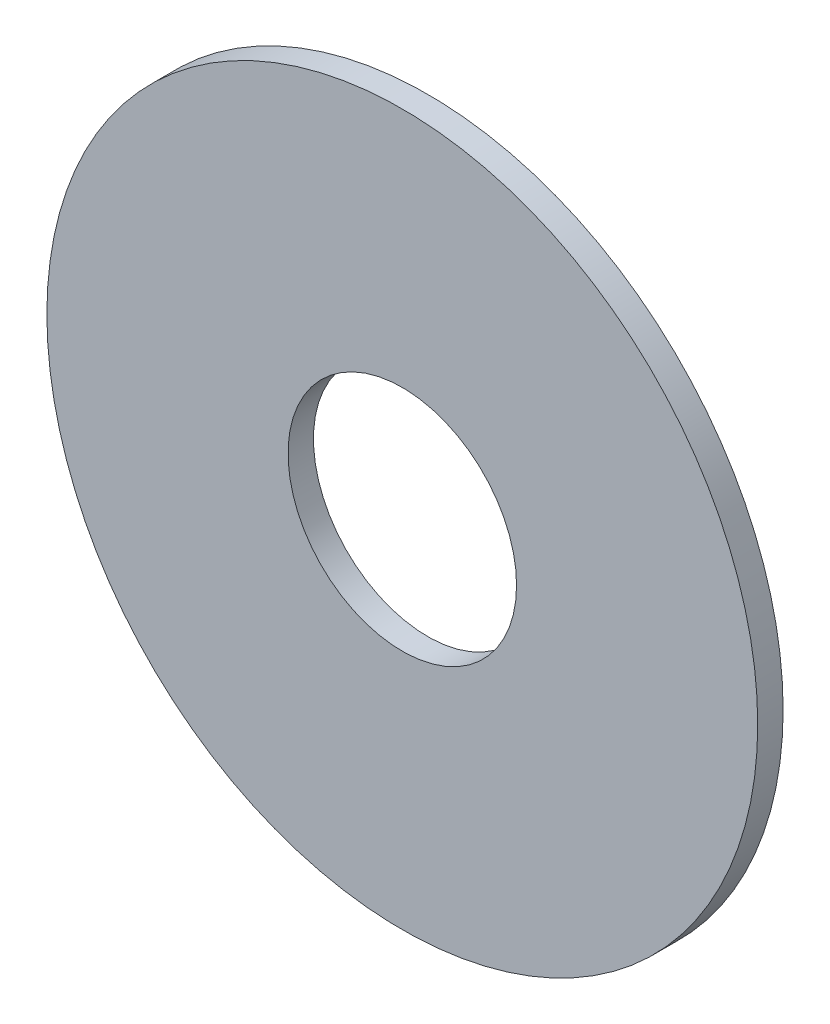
from build123d import *

# Parameters (mm, degrees)
SKETCH1_R           = 88.9
BOSS_EXTRUDE1_DEPTH = 6.35
SKETCH2_R           = 28.575
CUT_EXTRUDE1_DEPTH  = 6.35


with BuildPart() as part:
    # Sketch1 → Boss-Extrude1 (new body)
    with BuildSketch(Plane.XY):
        Circle(SKETCH1_R)
    extrude(amount=BOSS_EXTRUDE1_DEPTH)

    # Sketch2 → Cut-Extrude1 (cut)
    with BuildSketch(Plane.XY.offset(6.35)):
        Circle(SKETCH2_R)
    extrude(amount=-CUT_EXTRUDE1_DEPTH, mode=Mode.SUBTRACT)


solid = part.part
